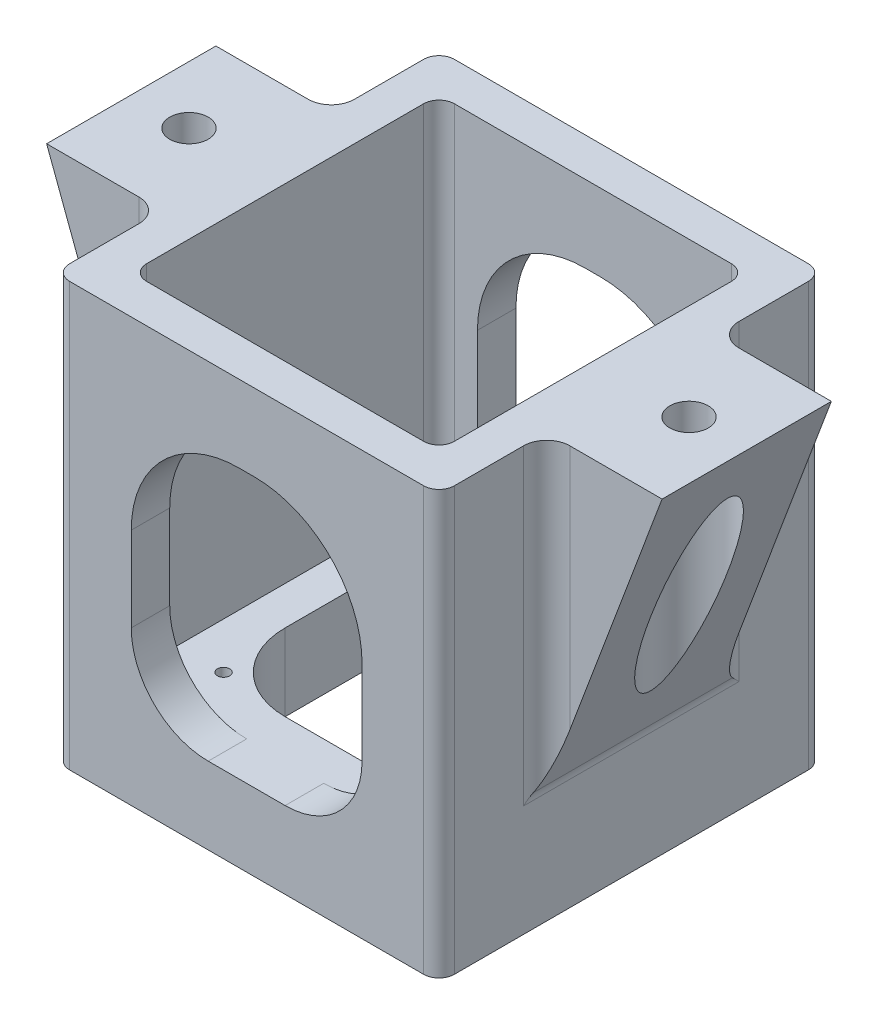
from build123d import *

# Parameters (mm, degrees)
ESBO_O1_W                = 50
ESBO_O1_H                = 50
RESSALTO_EXTRUS_O1_DEPTH = 55
ESBO_O2_W                = 40
ESBO_O2_H                = 40
CORTE_EXTRUS_O2_DEPTH    = 45
CORTE_EXTRUS_O4_DEPTH    = 10
RESSALTO_EXTRUS_O3_DEPTH = 11
ESBO_O6_R                = 2.5
CORTE_EXTRUS_O5_DEPTH    = 73.456883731
CORTE_EXTRUS_O8_START    = -4
ESBO_O7_R                = 5
CORTE_EXTRUS_O8_DEPTH    = 69.456883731
FILETE1_R                = 3
CORTE_EXTRUS_O9_REACH    = 86.41
FILETE2_R                = 2
CORTE_EXTRUS_O10_REACH   = 67.192
ESBO_O9_R                = 0.8


with BuildPart() as part:
    # Esbo_o1 → Ressalto-extrus_o1 (new body)
    with BuildSketch(Plane(origin=(0, 0, 0), x_dir=(1, 0, 0), z_dir=(0, 1, 0))):
        Rectangle(ESBO_O1_W, ESBO_O1_H)
    extrude(amount=RESSALTO_EXTRUS_O1_DEPTH)

    # Esbo_o2 → Corte-extrus_o2 (cut)
    with BuildSketch(Plane(origin=(0, 55, 0), x_dir=(1, 0, 0), z_dir=(0, 1, 0))):
        Rectangle(ESBO_O2_W, ESBO_O2_H)
    extrude(amount=-CORTE_EXTRUS_O2_DEPTH, mode=Mode.SUBTRACT)

    # Esbo_o3 → Corte-extrus_o4 (cut)
    with BuildSketch(Plane(origin=(0, 10, 0), x_dir=(1, 0, 0), z_dir=(0, 1, 0))):
        with BuildLine():
            Line((5, 15), (-5, 15))
            ThreePointArc((-5, 15), (-12.071067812, 12.071067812), (-15, 5))
            Line((-15, 5), (-15, -5))
            ThreePointArc((-15, -5), (-12.071067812, -12.071067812), (-5, -15))
            Line((-5, -15), (5, -15))
            ThreePointArc((5, -15), (12.071067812, -12.071067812), (15, -5))
            Line((15, -5), (15, 5))
            ThreePointArc((15, 5), (12.071067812, 12.071067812), (5, 15))
        make_face()
    extrude(amount=-CORTE_EXTRUS_O4_DEPTH, mode=Mode.SUBTRACT)

    # Esbo_o5 → Ressalto-extrus_o3 (add, symmetric)
    with BuildSketch(Plane.XY):
        Polygon((25, 55), (25, 15), (40, 55), align=None)
    ressalto_extrus_o3 = extrude(amount=RESSALTO_EXTRUS_O3_DEPTH, both=True)

    # Esbo_o6 → Corte-extrus_o5 (cut, through all)
    with BuildSketch(Plane(origin=(0, 55, 0), x_dir=(1, 0, 0), z_dir=(0, 1, 0))):
        with Locations(Location((32.5, 0, 0), (0, 0, 270))):
            Circle(ESBO_O6_R)
    corte_extrus_o5 = extrude(amount=-CORTE_EXTRUS_O5_DEPTH, mode=Mode.SUBTRACT)

    # Esbo_o7 → Corte-extrus_o8 (cut, through all)
    with BuildSketch(Plane(origin=(0, 55, 0), x_dir=(1, 0, 0), z_dir=(0, 1, 0)).offset(CORTE_EXTRUS_O8_START)):
        with Locations(Location((32.5, 0, 0), (0, 0, 270))):
            Circle(ESBO_O7_R)
    corte_extrus_o8 = extrude(amount=-CORTE_EXTRUS_O8_DEPTH, mode=Mode.SUBTRACT)

    # Espelhar5: Ressalto-extrus_o3, Corte-extrus_o5, Corte-extrus_o8 across plane
    add(ressalto_extrus_o3.mirror(Plane(origin=(0, 0, 0), x_dir=(0, 0, 1), z_dir=(1, 0, 0))))
    add(corte_extrus_o5.mirror(Plane(origin=(0, 0, 0), x_dir=(0, 0, 1), z_dir=(1, 0, 0))), mode=Mode.SUBTRACT)
    add(corte_extrus_o8.mirror(Plane(origin=(0, 0, 0), x_dir=(0, 0, 1), z_dir=(1, 0, 0))), mode=Mode.SUBTRACT)

    # Filete1
    filete1_edges = [part.edges().sort_by_distance(p)[0] for p in [
        (25, 35, -11),
        (25, 15, 0),
        (25, 35, 11),
        (-25, 35, 11),
        (-25, 35, -11),
    ]]
    fillet(filete1_edges, radius=FILETE1_R)

    # Esbo_o8 → Corte-extrus_o9 (cut, up to next)
    with BuildSketch(Plane(origin=(0, 0, -25), x_dir=(-1, 0, 0), z_dir=(0, 0, -1)), mode=Mode.PRIVATE) as corte_extrus_o9_sk1:
        with BuildLine():
            Line((-5, 10), (5, 10))
            ThreePointArc((5, 10), (12.071067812, 12.928932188), (15, 20))
            Line((15, 20), (15, 31))
            ThreePointArc((15, 31), (10.899494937, 40.899494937), (1, 45))
            Line((1, 45), (-1, 45))
            ThreePointArc((-1, 45), (-10.899494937, 40.899494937), (-15, 31))
            Line((-15, 31), (-15, 20))
            ThreePointArc((-15, 20), (-12.071067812, 12.928932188), (-5, 10))
        make_face()
    corte_extrus_o9_tool1 = extrude(corte_extrus_o9_sk1.sketch, amount=-CORTE_EXTRUS_O9_REACH, mode=Mode.PRIVATE) & part.part
    corte_extrus_o9 = corte_extrus_o9_tool1.solids().sort_by_distance((0, 26.899902, -25))[0]
    add(corte_extrus_o9, mode=Mode.SUBTRACT)

    # Espelhar8: Corte-extrus_o9 across plane
    add(corte_extrus_o9.mirror(Plane.XY), mode=Mode.SUBTRACT)

    # Filete2
    filete2_edges = [part.edges().sort_by_distance(p)[0] for p in [
        (20, 32.5, 20),
        (20, 32.5, -20),
        (-20, 32.5, -20),
        (-20, 32.5, 20),
        (25, 27.5, 25),
        (-25, 27.5, 25),
        (-25, 27.5, -25),
        (25, 27.5, -25),
    ]]
    fillet(filete2_edges, radius=FILETE2_R)

    # Esbo_o9 → Corte-extrus_o10 (cut, up to next)
    with BuildSketch(Plane(origin=(0, 10, 0), x_dir=(1, 0, 0), z_dir=(0, 1, 0)), mode=Mode.PRIVATE) as corte_extrus_o10_sk1:
        with Locations(Location((14, -14, 0), (0, 0, 270))):
            Circle(ESBO_O9_R)
    corte_extrus_o10_tool1 = extrude(corte_extrus_o10_sk1.sketch, amount=-CORTE_EXTRUS_O10_REACH, mode=Mode.PRIVATE) & part.part
    # Esbo_o9 → Corte-extrus_o10 (cut, up to next)
    with BuildSketch(Plane(origin=(0, 10, 0), x_dir=(1, 0, 0), z_dir=(0, 1, 0)), mode=Mode.PRIVATE) as corte_extrus_o10_sk2:
        with Locations(Location((-14, -14, 0), (0, 0, 270))):
            Circle(ESBO_O9_R)
    corte_extrus_o10_tool2 = extrude(corte_extrus_o10_sk2.sketch, amount=-CORTE_EXTRUS_O10_REACH, mode=Mode.PRIVATE) & part.part
    # Esbo_o9 → Corte-extrus_o10 (cut, up to next)
    with BuildSketch(Plane(origin=(0, 10, 0), x_dir=(1, 0, 0), z_dir=(0, 1, 0)), mode=Mode.PRIVATE) as corte_extrus_o10_sk3:
        with Locations(Location((-14, 14, 0), (0, 0, 270))):
            Circle(ESBO_O9_R)
    corte_extrus_o10_tool3 = extrude(corte_extrus_o10_sk3.sketch, amount=-CORTE_EXTRUS_O10_REACH, mode=Mode.PRIVATE) & part.part
    # Esbo_o9 → Corte-extrus_o10 (cut, up to next)
    with BuildSketch(Plane(origin=(0, 10, 0), x_dir=(1, 0, 0), z_dir=(0, 1, 0)), mode=Mode.PRIVATE) as corte_extrus_o10_sk4:
        with Locations(Location((14, 14, 0), (0, 0, 270))):
            Circle(ESBO_O9_R)
    corte_extrus_o10_tool4 = extrude(corte_extrus_o10_sk4.sketch, amount=-CORTE_EXTRUS_O10_REACH, mode=Mode.PRIVATE) & part.part
    add(corte_extrus_o10_tool1.solids().sort_by_distance((14, 10, 14))[0], mode=Mode.SUBTRACT)
    add(corte_extrus_o10_tool2.solids().sort_by_distance((-14, 10, 14))[0], mode=Mode.SUBTRACT)
    add(corte_extrus_o10_tool3.solids().sort_by_distance((-14, 10, -14))[0], mode=Mode.SUBTRACT)
    add(corte_extrus_o10_tool4.solids().sort_by_distance((14, 10, -14))[0], mode=Mode.SUBTRACT)


solid = part.part
